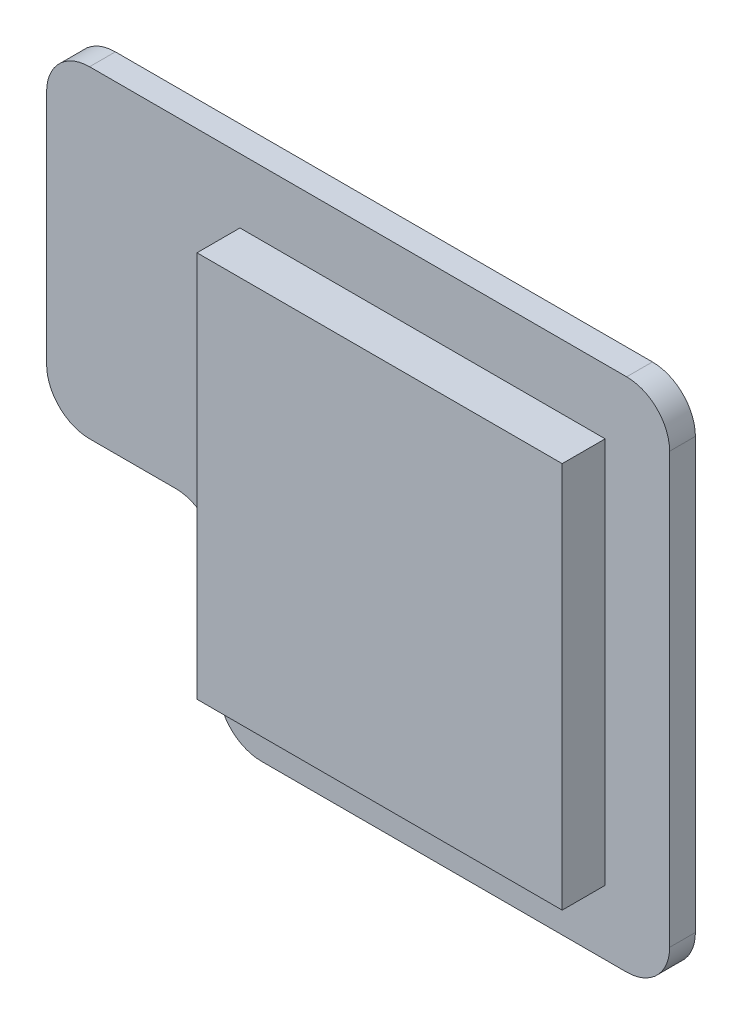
ISO-10303-21;
HEADER;
FILE_DESCRIPTION(('STEP AP214'),'2;1');
FILE_NAME('part.step','',(''),(''),'','','');
FILE_SCHEMA(('AUTOMOTIVE_DESIGN { 1 0 10303 214 1 1 1 1 }'));
ENDSEC;
DATA;
#1=APPLICATION_CONTEXT('core data for automotive mechanical design processes');
#2=APPLICATION_PROTOCOL_DEFINITION('international standard','automotive_design',2000,#1);
#3=PRODUCT_CONTEXT('',#1,'mechanical');
#4=PRODUCT('Part','Part','',(#3));
#5=PRODUCT_RELATED_PRODUCT_CATEGORY('part','',(#4));
#6=PRODUCT_DEFINITION_FORMATION('','',#4);
#7=PRODUCT_DEFINITION_CONTEXT('part definition',#1,'design');
#8=PRODUCT_DEFINITION('design','',#6,#7);
#9=PRODUCT_DEFINITION_SHAPE('','',#8);
#10=(LENGTH_UNIT() NAMED_UNIT(*) SI_UNIT(.MILLI.,.METRE.));
#11=(NAMED_UNIT(*) PLANE_ANGLE_UNIT() SI_UNIT($,.RADIAN.));
#12=(NAMED_UNIT(*) SI_UNIT($,.STERADIAN.) SOLID_ANGLE_UNIT());
#13=UNCERTAINTY_MEASURE_WITH_UNIT(LENGTH_MEASURE(1.E-05),#10,'distance_accuracy_value','');
#14=(GEOMETRIC_REPRESENTATION_CONTEXT(3) GLOBAL_UNCERTAINTY_ASSIGNED_CONTEXT((#13)) GLOBAL_UNIT_ASSIGNED_CONTEXT((#10,
#11,#12)) REPRESENTATION_CONTEXT('',''));
#15=CARTESIAN_POINT('',(0.,0.,0.));
#16=DIRECTION('',(0.,0.,1.));
#17=DIRECTION('',(1.,0.,0.));
#18=AXIS2_PLACEMENT_3D('',#15,#16,#17);
#19=CARTESIAN_POINT('',(-80.,-25.,6.));
#20=DIRECTION('',(0.,0.,1.));
#21=DIRECTION('',(1.,0.,0.));
#22=AXIS2_PLACEMENT_3D('',#19,#20,#21);
#23=PLANE('',#22);
#24=DIRECTION('',(-1.,0.,0.));
#25=VECTOR('',#24,1.);
#26=CARTESIAN_POINT('',(-80.,95.,6.));
#27=LINE('',#26,#25);
#28=CARTESIAN_POINT('',(55.,95.,6.));
#29=VERTEX_POINT('',#28);
#30=CARTESIAN_POINT('',(-70.,95.,6.));
#31=VERTEX_POINT('',#30);
#32=EDGE_CURVE('E210',#29,#31,#27,.T.);
#33=ORIENTED_EDGE('',*,*,#32,.T.);
#34=CARTESIAN_POINT('',(-70.,85.,6.));
#35=DIRECTION('',(0.,0.,1.));
#36=DIRECTION('',(1.,0.,0.));
#37=AXIS2_PLACEMENT_3D('',#34,#35,#36);
#38=CIRCLE('',#37,10.);
#39=CARTESIAN_POINT('',(-80.,85.,6.));
#40=VERTEX_POINT('',#39);
#41=EDGE_CURVE('E241',#31,#40,#38,.T.);
#42=ORIENTED_EDGE('',*,*,#41,.T.);
#43=DIRECTION('',(0.,-1.,0.));
#44=VECTOR('',#43,1.);
#45=CARTESIAN_POINT('',(-80.,20.,6.));
#46=LINE('',#45,#44);
#47=CARTESIAN_POINT('',(-80.,30.,6.));
#48=VERTEX_POINT('',#47);
#49=EDGE_CURVE('E196',#40,#48,#46,.T.);
#50=ORIENTED_EDGE('',*,*,#49,.T.);
#51=CARTESIAN_POINT('',(-70.,30.,6.));
#52=DIRECTION('',(0.,0.,1.));
#53=DIRECTION('',(1.,0.,0.));
#54=AXIS2_PLACEMENT_3D('',#51,#52,#53);
#55=CIRCLE('',#54,10.);
#56=CARTESIAN_POINT('',(-70.,20.,6.));
#57=VERTEX_POINT('',#56);
#58=EDGE_CURVE('E233',#48,#57,#55,.T.);
#59=ORIENTED_EDGE('',*,*,#58,.T.);
#60=DIRECTION('',(1.,0.,0.));
#61=VECTOR('',#60,1.);
#62=CARTESIAN_POINT('',(-40.,20.,6.));
#63=LINE('',#62,#61);
#64=CARTESIAN_POINT('',(-50.,20.,6.));
#65=VERTEX_POINT('',#64);
#66=EDGE_CURVE('E199',#57,#65,#63,.T.);
#67=ORIENTED_EDGE('',*,*,#66,.T.);
#68=CARTESIAN_POINT('',(-50.,10.,6.));
#69=DIRECTION('',(0.,0.,1.));
#70=DIRECTION('',(1.,0.,0.));
#71=AXIS2_PLACEMENT_3D('',#68,#69,#70);
#72=CIRCLE('',#71,10.);
#73=CARTESIAN_POINT('',(-40.,10.,6.));
#74=VERTEX_POINT('',#73);
#75=EDGE_CURVE('E11',#65,#74,#72,.F.);
#76=ORIENTED_EDGE('',*,*,#75,.T.);
#77=DIRECTION('',(0.,-1.,0.));
#78=VECTOR('',#77,1.);
#79=CARTESIAN_POINT('',(-40.,-25.,6.));
#80=LINE('',#79,#78);
#81=CARTESIAN_POINT('',(-40.,-15.,6.));
#82=VERTEX_POINT('',#81);
#83=EDGE_CURVE('E202',#74,#82,#80,.T.);
#84=ORIENTED_EDGE('',*,*,#83,.T.);
#85=CARTESIAN_POINT('',(-30.,-15.,6.));
#86=DIRECTION('',(0.,0.,1.));
#87=DIRECTION('',(1.,0.,0.));
#88=AXIS2_PLACEMENT_3D('',#85,#86,#87);
#89=CIRCLE('',#88,10.);
#90=CARTESIAN_POINT('',(-30.,-25.,6.));
#91=VERTEX_POINT('',#90);
#92=EDGE_CURVE('E235',#82,#91,#89,.T.);
#93=ORIENTED_EDGE('',*,*,#92,.T.);
#94=DIRECTION('',(1.,0.,0.));
#95=VECTOR('',#94,1.);
#96=CARTESIAN_POINT('',(65.,-25.,6.));
#97=LINE('',#96,#95);
#98=CARTESIAN_POINT('',(55.,-25.,6.));
#99=VERTEX_POINT('',#98);
#100=EDGE_CURVE('E205',#91,#99,#97,.T.);
#101=ORIENTED_EDGE('',*,*,#100,.T.);
#102=CARTESIAN_POINT('',(55.,-15.,6.));
#103=DIRECTION('',(0.,0.,1.));
#104=DIRECTION('',(1.,0.,0.));
#105=AXIS2_PLACEMENT_3D('',#102,#103,#104);
#106=CIRCLE('',#105,10.);
#107=CARTESIAN_POINT('',(65.,-15.,6.));
#108=VERTEX_POINT('',#107);
#109=EDGE_CURVE('E237',#99,#108,#106,.T.);
#110=ORIENTED_EDGE('',*,*,#109,.T.);
#111=DIRECTION('',(0.,1.,0.));
#112=VECTOR('',#111,1.);
#113=CARTESIAN_POINT('',(65.,95.,6.));
#114=LINE('',#113,#112);
#115=CARTESIAN_POINT('',(65.,85.,6.));
#116=VERTEX_POINT('',#115);
#117=EDGE_CURVE('E208',#108,#116,#114,.T.);
#118=ORIENTED_EDGE('',*,*,#117,.T.);
#119=CARTESIAN_POINT('',(55.,85.,6.));
#120=DIRECTION('',(0.,0.,1.));
#121=DIRECTION('',(1.,0.,0.));
#122=AXIS2_PLACEMENT_3D('',#119,#120,#121);
#123=CIRCLE('',#122,10.);
#124=EDGE_CURVE('E239',#116,#29,#123,.T.);
#125=ORIENTED_EDGE('',*,*,#124,.T.);
#126=EDGE_LOOP('',(#33,#42,#50,#59,#67,#76,#84,#93,#101,#110,#118,#125));
#127=FACE_BOUND('',#126,.T.);
#128=DIRECTION('',(1.,0.,0.));
#129=VECTOR('',#128,1.);
#130=CARTESIAN_POINT('',(-35.,-9.99999999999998,6.));
#131=LINE('',#130,#129);
#132=CARTESIAN_POINT('',(-35.,-9.99999999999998,6.));
#133=VERTEX_POINT('',#132);
#134=CARTESIAN_POINT('',(50.,-9.99999999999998,6.));
#135=VERTEX_POINT('',#134);
#136=EDGE_CURVE('E145',#133,#135,#131,.T.);
#137=ORIENTED_EDGE('',*,*,#136,.F.);
#138=DIRECTION('',(0.,-1.,0.));
#139=VECTOR('',#138,1.);
#140=CARTESIAN_POINT('',(-35.,-9.99999999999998,6.));
#141=LINE('',#140,#139);
#142=CARTESIAN_POINT('',(-35.,80.,6.));
#143=VERTEX_POINT('',#142);
#144=EDGE_CURVE('E156',#143,#133,#141,.T.);
#145=ORIENTED_EDGE('',*,*,#144,.F.);
#146=DIRECTION('',(-1.,0.,0.));
#147=VECTOR('',#146,1.);
#148=CARTESIAN_POINT('',(-35.,80.,6.));
#149=LINE('',#148,#147);
#150=CARTESIAN_POINT('',(50.,80.,6.));
#151=VERTEX_POINT('',#150);
#152=EDGE_CURVE('E166',#151,#143,#149,.T.);
#153=ORIENTED_EDGE('',*,*,#152,.F.);
#154=DIRECTION('',(0.,1.,0.));
#155=VECTOR('',#154,1.);
#156=CARTESIAN_POINT('',(50.,-9.99999999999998,6.));
#157=LINE('',#156,#155);
#158=EDGE_CURVE('E164',#135,#151,#157,.T.);
#159=ORIENTED_EDGE('',*,*,#158,.F.);
#160=EDGE_LOOP('',(#137,#145,#153,#159));
#161=FACE_BOUND('',#160,.T.);
#162=ADVANCED_FACE('F26',(#127,#161),#23,.T.);
#163=CARTESIAN_POINT('',(-80.,20.,6.));
#164=DIRECTION('',(1.,0.,0.));
#165=DIRECTION('',(0.,1.,0.));
#166=AXIS2_PLACEMENT_3D('',#163,#164,#165);
#167=PLANE('',#166);
#168=ORIENTED_EDGE('',*,*,#49,.F.);
#169=DIRECTION('',(0.,0.,-1.));
#170=VECTOR('',#169,1.);
#171=CARTESIAN_POINT('',(-80.,85.,6.));
#172=LINE('',#171,#170);
#173=CARTESIAN_POINT('',(-80.,85.,0.));
#174=VERTEX_POINT('',#173);
#175=EDGE_CURVE('E215',#40,#174,#172,.T.);
#176=ORIENTED_EDGE('',*,*,#175,.T.);
#177=DIRECTION('',(0.,-1.,0.));
#178=VECTOR('',#177,1.);
#179=CARTESIAN_POINT('',(-80.,20.,0.));
#180=LINE('',#179,#178);
#181=CARTESIAN_POINT('',(-80.,30.,0.));
#182=VERTEX_POINT('',#181);
#183=EDGE_CURVE('E151',#174,#182,#180,.T.);
#184=ORIENTED_EDGE('',*,*,#183,.T.);
#185=DIRECTION('',(0.,0.,-1.));
#186=VECTOR('',#185,1.);
#187=CARTESIAN_POINT('',(-80.,30.,6.));
#188=LINE('',#187,#186);
#189=EDGE_CURVE('E213',#182,#48,#188,.F.);
#190=ORIENTED_EDGE('',*,*,#189,.T.);
#191=EDGE_LOOP('',(#168,#176,#184,#190));
#192=FACE_BOUND('',#191,.T.);
#193=ADVANCED_FACE('F28',(#192),#167,.F.);
#194=CARTESIAN_POINT('',(-40.,20.,6.));
#195=DIRECTION('',(0.,1.,0.));
#196=DIRECTION('',(0.,0.,1.));
#197=AXIS2_PLACEMENT_3D('',#194,#195,#196);
#198=PLANE('',#197);
#199=ORIENTED_EDGE('',*,*,#66,.F.);
#200=DIRECTION('',(0.,0.,-1.));
#201=VECTOR('',#200,1.);
#202=CARTESIAN_POINT('',(-70.,20.,6.));
#203=LINE('',#202,#201);
#204=CARTESIAN_POINT('',(-70.,20.,0.));
#205=VERTEX_POINT('',#204);
#206=EDGE_CURVE('E259',#57,#205,#203,.T.);
#207=ORIENTED_EDGE('',*,*,#206,.T.);
#208=DIRECTION('',(1.,0.,0.));
#209=VECTOR('',#208,1.);
#210=CARTESIAN_POINT('',(-40.,20.,0.));
#211=LINE('',#210,#209);
#212=CARTESIAN_POINT('',(-50.,20.,0.));
#213=VERTEX_POINT('',#212);
#214=EDGE_CURVE('E182',#205,#213,#211,.T.);
#215=ORIENTED_EDGE('',*,*,#214,.T.);
#216=DIRECTION('',(0.,0.,-1.));
#217=VECTOR('',#216,1.);
#218=CARTESIAN_POINT('',(-50.,20.,6.));
#219=LINE('',#218,#217);
#220=EDGE_CURVE('E257',#213,#65,#219,.F.);
#221=ORIENTED_EDGE('',*,*,#220,.T.);
#222=EDGE_LOOP('',(#199,#207,#215,#221));
#223=FACE_BOUND('',#222,.T.);
#224=ADVANCED_FACE('F271',(#223),#198,.F.);
#225=CARTESIAN_POINT('',(-40.,-25.,6.));
#226=DIRECTION('',(1.,0.,0.));
#227=DIRECTION('',(0.,1.,0.));
#228=AXIS2_PLACEMENT_3D('',#225,#226,#227);
#229=PLANE('',#228);
#230=DIRECTION('',(0.,-1.,0.));
#231=VECTOR('',#230,1.);
#232=CARTESIAN_POINT('',(-40.,-25.,0.));
#233=LINE('',#232,#231);
#234=CARTESIAN_POINT('',(-40.,10.,0.));
#235=VERTEX_POINT('',#234);
#236=CARTESIAN_POINT('',(-40.,-15.,0.));
#237=VERTEX_POINT('',#236);
#238=EDGE_CURVE('E185',#235,#237,#233,.T.);
#239=ORIENTED_EDGE('',*,*,#238,.T.);
#240=DIRECTION('',(0.,0.,-1.));
#241=VECTOR('',#240,1.);
#242=CARTESIAN_POINT('',(-40.,-15.,6.));
#243=LINE('',#242,#241);
#244=EDGE_CURVE('E255',#237,#82,#243,.F.);
#245=ORIENTED_EDGE('',*,*,#244,.T.);
#246=ORIENTED_EDGE('',*,*,#83,.F.);
#247=DIRECTION('',(0.,0.,-1.));
#248=VECTOR('',#247,1.);
#249=CARTESIAN_POINT('',(-40.,10.,0.));
#250=LINE('',#249,#248);
#251=EDGE_CURVE('E252',#74,#235,#250,.T.);
#252=ORIENTED_EDGE('',*,*,#251,.T.);
#253=EDGE_LOOP('',(#239,#245,#246,#252));
#254=FACE_BOUND('',#253,.T.);
#255=ADVANCED_FACE('F279',(#254),#229,.F.);
#256=CARTESIAN_POINT('',(65.,-25.,6.));
#257=DIRECTION('',(0.,1.,0.));
#258=DIRECTION('',(-1.,0.,0.));
#259=AXIS2_PLACEMENT_3D('',#256,#257,#258);
#260=PLANE('',#259);
#261=DIRECTION('',(1.,0.,0.));
#262=VECTOR('',#261,1.);
#263=CARTESIAN_POINT('',(65.,-25.,0.));
#264=LINE('',#263,#262);
#265=CARTESIAN_POINT('',(-30.,-25.,0.));
#266=VERTEX_POINT('',#265);
#267=CARTESIAN_POINT('',(55.,-25.,0.));
#268=VERTEX_POINT('',#267);
#269=EDGE_CURVE('E188',#266,#268,#264,.T.);
#270=ORIENTED_EDGE('',*,*,#269,.T.);
#271=DIRECTION('',(0.,0.,-1.));
#272=VECTOR('',#271,1.);
#273=CARTESIAN_POINT('',(55.,-25.,6.));
#274=LINE('',#273,#272);
#275=EDGE_CURVE('E250',#268,#99,#274,.F.);
#276=ORIENTED_EDGE('',*,*,#275,.T.);
#277=ORIENTED_EDGE('',*,*,#100,.F.);
#278=DIRECTION('',(0.,0.,-1.));
#279=VECTOR('',#278,1.);
#280=CARTESIAN_POINT('',(-30.,-25.,6.));
#281=LINE('',#280,#279);
#282=EDGE_CURVE('E247',#91,#266,#281,.T.);
#283=ORIENTED_EDGE('',*,*,#282,.T.);
#284=EDGE_LOOP('',(#270,#276,#277,#283));
#285=FACE_BOUND('',#284,.T.);
#286=ADVANCED_FACE('F287',(#285),#260,.F.);
#287=CARTESIAN_POINT('',(65.,95.,6.));
#288=DIRECTION('',(-1.,0.,0.));
#289=DIRECTION('',(0.,-1.,0.));
#290=AXIS2_PLACEMENT_3D('',#287,#288,#289);
#291=PLANE('',#290);
#292=DIRECTION('',(0.,1.,0.));
#293=VECTOR('',#292,1.);
#294=CARTESIAN_POINT('',(65.,95.,0.));
#295=LINE('',#294,#293);
#296=CARTESIAN_POINT('',(65.,-15.,0.));
#297=VERTEX_POINT('',#296);
#298=CARTESIAN_POINT('',(65.,85.,0.));
#299=VERTEX_POINT('',#298);
#300=EDGE_CURVE('E191',#297,#299,#295,.T.);
#301=ORIENTED_EDGE('',*,*,#300,.T.);
#302=DIRECTION('',(0.,0.,-1.));
#303=VECTOR('',#302,1.);
#304=CARTESIAN_POINT('',(65.,85.,6.));
#305=LINE('',#304,#303);
#306=EDGE_CURVE('E49',#299,#116,#305,.F.);
#307=ORIENTED_EDGE('',*,*,#306,.T.);
#308=ORIENTED_EDGE('',*,*,#117,.F.);
#309=DIRECTION('',(0.,0.,-1.));
#310=VECTOR('',#309,1.);
#311=CARTESIAN_POINT('',(65.,-15.,6.));
#312=LINE('',#311,#310);
#313=EDGE_CURVE('E243',#108,#297,#312,.T.);
#314=ORIENTED_EDGE('',*,*,#313,.T.);
#315=EDGE_LOOP('',(#301,#307,#308,#314));
#316=FACE_BOUND('',#315,.T.);
#317=ADVANCED_FACE('F294',(#316),#291,.F.);
#318=CARTESIAN_POINT('',(-80.,95.,6.));
#319=DIRECTION('',(0.,-1.,0.));
#320=DIRECTION('',(1.,0.,0.));
#321=AXIS2_PLACEMENT_3D('',#318,#319,#320);
#322=PLANE('',#321);
#323=DIRECTION('',(-1.,0.,0.));
#324=VECTOR('',#323,1.);
#325=CARTESIAN_POINT('',(-80.,95.,0.));
#326=LINE('',#325,#324);
#327=CARTESIAN_POINT('',(55.,95.,0.));
#328=VERTEX_POINT('',#327);
#329=CARTESIAN_POINT('',(-70.,95.,0.));
#330=VERTEX_POINT('',#329);
#331=EDGE_CURVE('E193',#328,#330,#326,.T.);
#332=ORIENTED_EDGE('',*,*,#331,.T.);
#333=DIRECTION('',(0.,0.,-1.));
#334=VECTOR('',#333,1.);
#335=CARTESIAN_POINT('',(-70.,95.,6.));
#336=LINE('',#335,#334);
#337=EDGE_CURVE('E231',#330,#31,#336,.F.);
#338=ORIENTED_EDGE('',*,*,#337,.T.);
#339=ORIENTED_EDGE('',*,*,#32,.F.);
#340=DIRECTION('',(0.,0.,-1.));
#341=VECTOR('',#340,1.);
#342=CARTESIAN_POINT('',(55.,95.,6.));
#343=LINE('',#342,#341);
#344=EDGE_CURVE('E228',#29,#328,#343,.T.);
#345=ORIENTED_EDGE('',*,*,#344,.T.);
#346=EDGE_LOOP('',(#332,#338,#339,#345));
#347=FACE_BOUND('',#346,.T.);
#348=ADVANCED_FACE('F302',(#347),#322,.F.);
#349=CARTESIAN_POINT('',(-80.,-25.,0.));
#350=DIRECTION('',(0.,0.,1.));
#351=DIRECTION('',(1.,0.,0.));
#352=AXIS2_PLACEMENT_3D('',#349,#350,#351);
#353=PLANE('',#352);
#354=ORIENTED_EDGE('',*,*,#183,.F.);
#355=CARTESIAN_POINT('',(-70.,85.,0.));
#356=DIRECTION('',(0.,0.,1.));
#357=DIRECTION('',(1.,0.,0.));
#358=AXIS2_PLACEMENT_3D('',#355,#356,#357);
#359=CIRCLE('',#358,10.);
#360=EDGE_CURVE('E226',#174,#330,#359,.F.);
#361=ORIENTED_EDGE('',*,*,#360,.T.);
#362=ORIENTED_EDGE('',*,*,#331,.F.);
#363=CARTESIAN_POINT('',(55.,85.,0.));
#364=DIRECTION('',(0.,0.,1.));
#365=DIRECTION('',(1.,0.,0.));
#366=AXIS2_PLACEMENT_3D('',#363,#364,#365);
#367=CIRCLE('',#366,10.);
#368=EDGE_CURVE('E224',#328,#299,#367,.F.);
#369=ORIENTED_EDGE('',*,*,#368,.T.);
#370=ORIENTED_EDGE('',*,*,#300,.F.);
#371=CARTESIAN_POINT('',(55.,-15.,0.));
#372=DIRECTION('',(0.,0.,1.));
#373=DIRECTION('',(1.,0.,0.));
#374=AXIS2_PLACEMENT_3D('',#371,#372,#373);
#375=CIRCLE('',#374,10.);
#376=EDGE_CURVE('E222',#297,#268,#375,.F.);
#377=ORIENTED_EDGE('',*,*,#376,.T.);
#378=ORIENTED_EDGE('',*,*,#269,.F.);
#379=CARTESIAN_POINT('',(-30.,-15.,0.));
#380=DIRECTION('',(0.,0.,1.));
#381=DIRECTION('',(1.,0.,0.));
#382=AXIS2_PLACEMENT_3D('',#379,#380,#381);
#383=CIRCLE('',#382,10.);
#384=EDGE_CURVE('E220',#266,#237,#383,.F.);
#385=ORIENTED_EDGE('',*,*,#384,.T.);
#386=ORIENTED_EDGE('',*,*,#238,.F.);
#387=CARTESIAN_POINT('',(-50.,10.,0.));
#388=DIRECTION('',(0.,0.,1.));
#389=DIRECTION('',(1.,0.,0.));
#390=AXIS2_PLACEMENT_3D('',#387,#388,#389);
#391=CIRCLE('',#390,10.);
#392=EDGE_CURVE('E34',#235,#213,#391,.T.);
#393=ORIENTED_EDGE('',*,*,#392,.T.);
#394=ORIENTED_EDGE('',*,*,#214,.F.);
#395=CARTESIAN_POINT('',(-70.,30.,0.));
#396=DIRECTION('',(0.,0.,1.));
#397=DIRECTION('',(1.,0.,0.));
#398=AXIS2_PLACEMENT_3D('',#395,#396,#397);
#399=CIRCLE('',#398,10.);
#400=EDGE_CURVE('E218',#205,#182,#399,.F.);
#401=ORIENTED_EDGE('',*,*,#400,.T.);
#402=EDGE_LOOP('',(#354,#361,#362,#369,#370,#377,#378,#385,#386,#393,#394,#401));
#403=FACE_BOUND('',#402,.T.);
#404=ADVANCED_FACE('F265',(#403),#353,.F.);
#405=CARTESIAN_POINT('',(-70.,85.,6.));
#406=DIRECTION('',(0.,0.,-1.));
#407=DIRECTION('',(-1.,0.,0.));
#408=AXIS2_PLACEMENT_3D('',#405,#406,#407);
#409=CYLINDRICAL_SURFACE('',#408,10.);
#410=ORIENTED_EDGE('',*,*,#41,.F.);
#411=ORIENTED_EDGE('',*,*,#337,.F.);
#412=ORIENTED_EDGE('',*,*,#360,.F.);
#413=ORIENTED_EDGE('',*,*,#175,.F.);
#414=EDGE_LOOP('',(#410,#411,#412,#413));
#415=FACE_BOUND('',#414,.T.);
#416=ADVANCED_FACE('F308',(#415),#409,.T.);
#417=CARTESIAN_POINT('',(55.,85.,6.));
#418=DIRECTION('',(0.,0.,-1.));
#419=DIRECTION('',(-1.,0.,0.));
#420=AXIS2_PLACEMENT_3D('',#417,#418,#419);
#421=CYLINDRICAL_SURFACE('',#420,10.);
#422=ORIENTED_EDGE('',*,*,#124,.F.);
#423=ORIENTED_EDGE('',*,*,#306,.F.);
#424=ORIENTED_EDGE('',*,*,#368,.F.);
#425=ORIENTED_EDGE('',*,*,#344,.F.);
#426=EDGE_LOOP('',(#422,#423,#424,#425));
#427=FACE_BOUND('',#426,.T.);
#428=ADVANCED_FACE('F299',(#427),#421,.T.);
#429=CARTESIAN_POINT('',(55.,-15.,6.));
#430=DIRECTION('',(0.,0.,-1.));
#431=DIRECTION('',(-1.,0.,0.));
#432=AXIS2_PLACEMENT_3D('',#429,#430,#431);
#433=CYLINDRICAL_SURFACE('',#432,10.);
#434=ORIENTED_EDGE('',*,*,#109,.F.);
#435=ORIENTED_EDGE('',*,*,#275,.F.);
#436=ORIENTED_EDGE('',*,*,#376,.F.);
#437=ORIENTED_EDGE('',*,*,#313,.F.);
#438=EDGE_LOOP('',(#434,#435,#436,#437));
#439=FACE_BOUND('',#438,.T.);
#440=ADVANCED_FACE('F291',(#439),#433,.T.);
#441=CARTESIAN_POINT('',(-30.,-15.,6.));
#442=DIRECTION('',(0.,0.,-1.));
#443=DIRECTION('',(-1.,0.,0.));
#444=AXIS2_PLACEMENT_3D('',#441,#442,#443);
#445=CYLINDRICAL_SURFACE('',#444,10.);
#446=ORIENTED_EDGE('',*,*,#92,.F.);
#447=ORIENTED_EDGE('',*,*,#244,.F.);
#448=ORIENTED_EDGE('',*,*,#384,.F.);
#449=ORIENTED_EDGE('',*,*,#282,.F.);
#450=EDGE_LOOP('',(#446,#447,#448,#449));
#451=FACE_BOUND('',#450,.T.);
#452=ADVANCED_FACE('F282',(#451),#445,.T.);
#453=CARTESIAN_POINT('',(-70.,30.,6.));
#454=DIRECTION('',(0.,0.,-1.));
#455=DIRECTION('',(-1.,0.,0.));
#456=AXIS2_PLACEMENT_3D('',#453,#454,#455);
#457=CYLINDRICAL_SURFACE('',#456,10.);
#458=ORIENTED_EDGE('',*,*,#58,.F.);
#459=ORIENTED_EDGE('',*,*,#189,.F.);
#460=ORIENTED_EDGE('',*,*,#400,.F.);
#461=ORIENTED_EDGE('',*,*,#206,.F.);
#462=EDGE_LOOP('',(#458,#459,#460,#461));
#463=FACE_BOUND('',#462,.T.);
#464=ADVANCED_FACE('F313',(#463),#457,.T.);
#465=CARTESIAN_POINT('',(-50.,10.,6.));
#466=DIRECTION('',(0.,0.,1.));
#467=DIRECTION('',(1.,0.,0.));
#468=AXIS2_PLACEMENT_3D('',#465,#466,#467);
#469=CYLINDRICAL_SURFACE('',#468,10.);
#470=ORIENTED_EDGE('',*,*,#75,.F.);
#471=ORIENTED_EDGE('',*,*,#220,.F.);
#472=ORIENTED_EDGE('',*,*,#392,.F.);
#473=ORIENTED_EDGE('',*,*,#251,.F.);
#474=EDGE_LOOP('',(#470,#471,#472,#473));
#475=FACE_BOUND('',#474,.T.);
#476=ADVANCED_FACE('F274',(#475),#469,.F.);
#477=CARTESIAN_POINT('',(-35.,-9.99999999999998,16.));
#478=DIRECTION('',(1.,0.,0.));
#479=DIRECTION('',(0.,0.,-1.));
#480=AXIS2_PLACEMENT_3D('',#477,#478,#479);
#481=PLANE('',#480);
#482=ORIENTED_EDGE('',*,*,#144,.T.);
#483=DIRECTION('',(0.,0.,-1.));
#484=VECTOR('',#483,1.);
#485=CARTESIAN_POINT('',(-35.,-9.99999999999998,16.));
#486=LINE('',#485,#484);
#487=CARTESIAN_POINT('',(-35.,-9.99999999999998,16.));
#488=VERTEX_POINT('',#487);
#489=EDGE_CURVE('E140',#488,#133,#486,.T.);
#490=ORIENTED_EDGE('',*,*,#489,.F.);
#491=DIRECTION('',(0.,-1.,0.));
#492=VECTOR('',#491,1.);
#493=CARTESIAN_POINT('',(-35.,-9.99999999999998,16.));
#494=LINE('',#493,#492);
#495=CARTESIAN_POINT('',(-35.,80.,16.));
#496=VERTEX_POINT('',#495);
#497=EDGE_CURVE('E170',#496,#488,#494,.T.);
#498=ORIENTED_EDGE('',*,*,#497,.F.);
#499=DIRECTION('',(0.,0.,-1.));
#500=VECTOR('',#499,1.);
#501=CARTESIAN_POINT('',(-35.,80.,16.));
#502=LINE('',#501,#500);
#503=EDGE_CURVE('E159',#496,#143,#502,.T.);
#504=ORIENTED_EDGE('',*,*,#503,.T.);
#505=EDGE_LOOP('',(#482,#490,#498,#504));
#506=FACE_BOUND('',#505,.T.);
#507=ADVANCED_FACE('F157',(#506),#481,.F.);
#508=CARTESIAN_POINT('',(-35.,-9.99999999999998,16.));
#509=DIRECTION('',(0.,1.,0.));
#510=DIRECTION('',(0.,0.,1.));
#511=AXIS2_PLACEMENT_3D('',#508,#509,#510);
#512=PLANE('',#511);
#513=ORIENTED_EDGE('',*,*,#136,.T.);
#514=DIRECTION('',(0.,0.,-1.));
#515=VECTOR('',#514,1.);
#516=CARTESIAN_POINT('',(50.,-9.99999999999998,16.));
#517=LINE('',#516,#515);
#518=CARTESIAN_POINT('',(50.,-9.99999999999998,16.));
#519=VERTEX_POINT('',#518);
#520=EDGE_CURVE('E152',#519,#135,#517,.T.);
#521=ORIENTED_EDGE('',*,*,#520,.F.);
#522=DIRECTION('',(1.,0.,0.));
#523=VECTOR('',#522,1.);
#524=CARTESIAN_POINT('',(-35.,-9.99999999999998,16.));
#525=LINE('',#524,#523);
#526=EDGE_CURVE('E147',#488,#519,#525,.T.);
#527=ORIENTED_EDGE('',*,*,#526,.F.);
#528=ORIENTED_EDGE('',*,*,#489,.T.);
#529=EDGE_LOOP('',(#513,#521,#527,#528));
#530=FACE_BOUND('',#529,.T.);
#531=ADVANCED_FACE('F142',(#530),#512,.F.);
#532=CARTESIAN_POINT('',(50.,-9.99999999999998,16.));
#533=DIRECTION('',(-1.,0.,0.));
#534=DIRECTION('',(0.,0.,1.));
#535=AXIS2_PLACEMENT_3D('',#532,#533,#534);
#536=PLANE('',#535);
#537=ORIENTED_EDGE('',*,*,#158,.T.);
#538=DIRECTION('',(0.,0.,-1.));
#539=VECTOR('',#538,1.);
#540=CARTESIAN_POINT('',(50.,80.,16.));
#541=LINE('',#540,#539);
#542=CARTESIAN_POINT('',(50.,80.,16.));
#543=VERTEX_POINT('',#542);
#544=EDGE_CURVE('E41',#543,#151,#541,.T.);
#545=ORIENTED_EDGE('',*,*,#544,.F.);
#546=DIRECTION('',(0.,1.,0.));
#547=VECTOR('',#546,1.);
#548=CARTESIAN_POINT('',(50.,-9.99999999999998,16.));
#549=LINE('',#548,#547);
#550=EDGE_CURVE('E173',#519,#543,#549,.T.);
#551=ORIENTED_EDGE('',*,*,#550,.F.);
#552=ORIENTED_EDGE('',*,*,#520,.T.);
#553=EDGE_LOOP('',(#537,#545,#551,#552));
#554=FACE_BOUND('',#553,.T.);
#555=ADVANCED_FACE('F405',(#554),#536,.F.);
#556=CARTESIAN_POINT('',(-35.,80.,16.));
#557=DIRECTION('',(0.,-1.,0.));
#558=DIRECTION('',(0.,0.,-1.));
#559=AXIS2_PLACEMENT_3D('',#556,#557,#558);
#560=PLANE('',#559);
#561=ORIENTED_EDGE('',*,*,#152,.T.);
#562=ORIENTED_EDGE('',*,*,#503,.F.);
#563=DIRECTION('',(-1.,0.,0.));
#564=VECTOR('',#563,1.);
#565=CARTESIAN_POINT('',(-35.,80.,16.));
#566=LINE('',#565,#564);
#567=EDGE_CURVE('E175',#543,#496,#566,.T.);
#568=ORIENTED_EDGE('',*,*,#567,.F.);
#569=ORIENTED_EDGE('',*,*,#544,.T.);
#570=EDGE_LOOP('',(#561,#562,#568,#569));
#571=FACE_BOUND('',#570,.T.);
#572=ADVANCED_FACE('F412',(#571),#560,.F.);
#573=CARTESIAN_POINT('',(-35.,80.,16.));
#574=DIRECTION('',(0.,0.,-1.));
#575=DIRECTION('',(-1.,0.,0.));
#576=AXIS2_PLACEMENT_3D('',#573,#574,#575);
#577=PLANE('',#576);
#578=ORIENTED_EDGE('',*,*,#497,.T.);
#579=ORIENTED_EDGE('',*,*,#526,.T.);
#580=ORIENTED_EDGE('',*,*,#550,.T.);
#581=ORIENTED_EDGE('',*,*,#567,.T.);
#582=EDGE_LOOP('',(#578,#579,#580,#581));
#583=FACE_BOUND('',#582,.T.);
#584=ADVANCED_FACE('F420',(#583),#577,.F.);
#585=CLOSED_SHELL('',(#162,#193,#224,#255,#286,#317,#348,#404,#416,#428,#440,#452,#464,#476,
#507,#531,#555,#572,#584));
#586=MANIFOLD_SOLID_BREP('B2',#585);
#587=ADVANCED_BREP_SHAPE_REPRESENTATION('',(#18,#586),#14);
#588=SHAPE_DEFINITION_REPRESENTATION(#9,#587);
ENDSEC;
END-ISO-10303-21;
